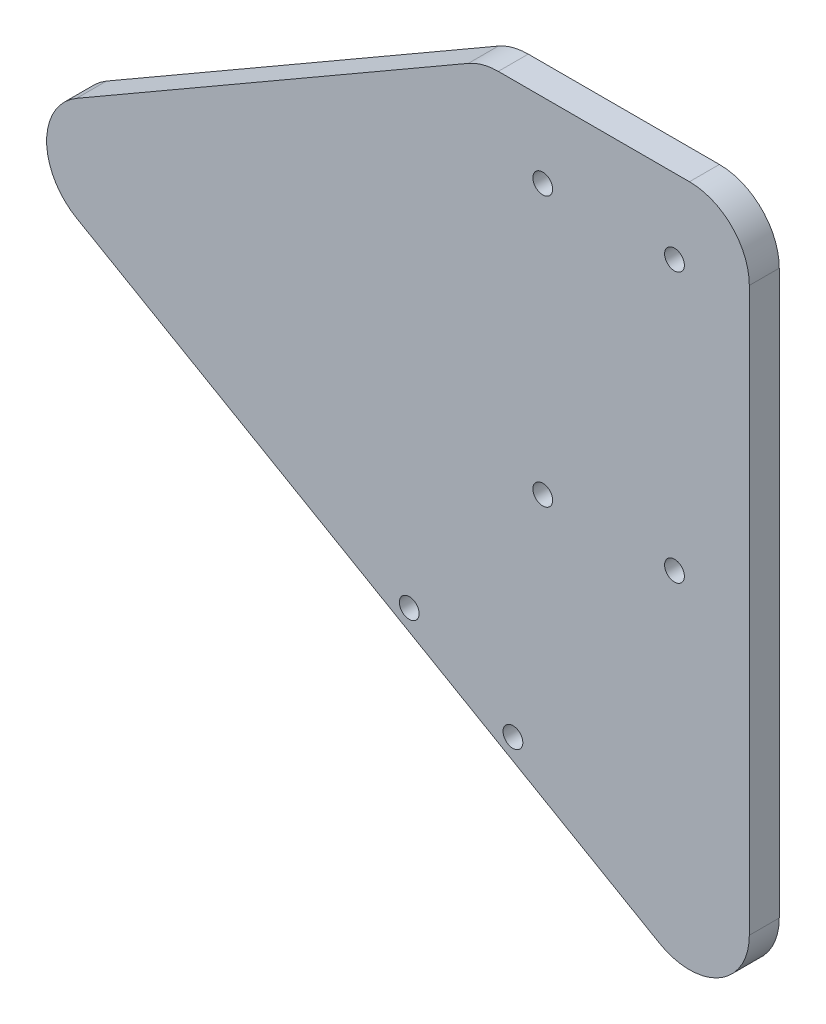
ISO-10303-21;
HEADER;
FILE_DESCRIPTION(('STEP AP214'),'2;1');
FILE_NAME('part.step','',(''),(''),'','','');
FILE_SCHEMA(('AUTOMOTIVE_DESIGN { 1 0 10303 214 1 1 1 1 }'));
ENDSEC;
DATA;
#1=APPLICATION_CONTEXT('core data for automotive mechanical design processes');
#2=APPLICATION_PROTOCOL_DEFINITION('international standard','automotive_design',2000,#1);
#3=PRODUCT_CONTEXT('',#1,'mechanical');
#4=PRODUCT('Part','Part','',(#3));
#5=PRODUCT_RELATED_PRODUCT_CATEGORY('part','',(#4));
#6=PRODUCT_DEFINITION_FORMATION('','',#4);
#7=PRODUCT_DEFINITION_CONTEXT('part definition',#1,'design');
#8=PRODUCT_DEFINITION('design','',#6,#7);
#9=PRODUCT_DEFINITION_SHAPE('','',#8);
#10=(LENGTH_UNIT() NAMED_UNIT(*) SI_UNIT(.MILLI.,.METRE.));
#11=(NAMED_UNIT(*) PLANE_ANGLE_UNIT() SI_UNIT($,.RADIAN.));
#12=(NAMED_UNIT(*) SI_UNIT($,.STERADIAN.) SOLID_ANGLE_UNIT());
#13=UNCERTAINTY_MEASURE_WITH_UNIT(LENGTH_MEASURE(1.E-05),#10,'distance_accuracy_value','');
#14=(GEOMETRIC_REPRESENTATION_CONTEXT(3) GLOBAL_UNCERTAINTY_ASSIGNED_CONTEXT((#13)) GLOBAL_UNIT_ASSIGNED_CONTEXT((#10,
#11,#12)) REPRESENTATION_CONTEXT('',''));
#15=CARTESIAN_POINT('',(0.,0.,0.));
#16=DIRECTION('',(0.,0.,1.));
#17=DIRECTION('',(1.,0.,0.));
#18=AXIS2_PLACEMENT_3D('',#15,#16,#17);
#19=CARTESIAN_POINT('',(13.5,25.,5.));
#20=DIRECTION('',(0.,0.,1.));
#21=DIRECTION('',(1.,0.,0.));
#22=AXIS2_PLACEMENT_3D('',#19,#20,#21);
#23=CYLINDRICAL_SURFACE('',#22,10.);
#24=CARTESIAN_POINT('',(13.5,25.,5.));
#25=DIRECTION('',(0.,0.,1.));
#26=DIRECTION('',(1.,0.,0.));
#27=AXIS2_PLACEMENT_3D('',#24,#25,#26);
#28=CIRCLE('',#27,10.);
#29=CARTESIAN_POINT('',(23.5,25.,5.));
#30=VERTEX_POINT('',#29);
#31=CARTESIAN_POINT('',(13.5,35.,5.));
#32=VERTEX_POINT('',#31);
#33=EDGE_CURVE('E105',#30,#32,#28,.T.);
#34=ORIENTED_EDGE('',*,*,#33,.F.);
#35=DIRECTION('',(0.,0.,1.));
#36=VECTOR('',#35,1.);
#37=CARTESIAN_POINT('',(23.5,25.,5.));
#38=LINE('',#37,#36);
#39=CARTESIAN_POINT('',(23.5,25.,0.));
#40=VERTEX_POINT('',#39);
#41=EDGE_CURVE('E169',#40,#30,#38,.T.);
#42=ORIENTED_EDGE('',*,*,#41,.F.);
#43=CARTESIAN_POINT('',(13.5,25.,0.));
#44=DIRECTION('',(0.,0.,-1.));
#45=DIRECTION('',(1.,0.,0.));
#46=AXIS2_PLACEMENT_3D('',#43,#44,#45);
#47=CIRCLE('',#46,10.);
#48=CARTESIAN_POINT('',(13.5,35.,0.));
#49=VERTEX_POINT('',#48);
#50=EDGE_CURVE('E11',#49,#40,#47,.T.);
#51=ORIENTED_EDGE('',*,*,#50,.F.);
#52=DIRECTION('',(0.,0.,-1.));
#53=VECTOR('',#52,1.);
#54=CARTESIAN_POINT('',(13.5,35.,0.));
#55=LINE('',#54,#53);
#56=EDGE_CURVE('E121',#32,#49,#55,.T.);
#57=ORIENTED_EDGE('',*,*,#56,.F.);
#58=EDGE_LOOP('',(#34,#42,#51,#57));
#59=FACE_BOUND('',#58,.T.);
#60=ADVANCED_FACE('F17',(#59),#23,.T.);
#61=CARTESIAN_POINT('',(-18.4241377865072,25.,5.));
#62=DIRECTION('',(0.,0.,-1.));
#63=DIRECTION('',(-1.,0.,0.));
#64=AXIS2_PLACEMENT_3D('',#61,#62,#63);
#65=CYLINDRICAL_SURFACE('',#64,10.);
#66=CARTESIAN_POINT('',(-18.4241377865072,25.,5.));
#67=DIRECTION('',(0.,0.,1.));
#68=DIRECTION('',(1.,0.,0.));
#69=AXIS2_PLACEMENT_3D('',#66,#67,#68);
#70=CIRCLE('',#69,10.);
#71=CARTESIAN_POINT('',(-18.4241377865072,35.,5.));
#72=VERTEX_POINT('',#71);
#73=CARTESIAN_POINT('',(-23.4241377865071,33.6602540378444,5.));
#74=VERTEX_POINT('',#73);
#75=EDGE_CURVE('E38',#72,#74,#70,.T.);
#76=ORIENTED_EDGE('',*,*,#75,.F.);
#77=DIRECTION('',(0.,0.,1.));
#78=VECTOR('',#77,1.);
#79=CARTESIAN_POINT('',(-18.4241377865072,35.,5.));
#80=LINE('',#79,#78);
#81=CARTESIAN_POINT('',(-18.4241377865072,35.,0.));
#82=VERTEX_POINT('',#81);
#83=EDGE_CURVE('E130',#82,#72,#80,.T.);
#84=ORIENTED_EDGE('',*,*,#83,.F.);
#85=CARTESIAN_POINT('',(-18.4241377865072,25.,0.));
#86=DIRECTION('',(0.,0.,-1.));
#87=DIRECTION('',(1.,0.,0.));
#88=AXIS2_PLACEMENT_3D('',#85,#86,#87);
#89=CIRCLE('',#88,10.);
#90=CARTESIAN_POINT('',(-23.4241377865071,33.6602540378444,0.));
#91=VERTEX_POINT('',#90);
#92=EDGE_CURVE('E25',#91,#82,#89,.T.);
#93=ORIENTED_EDGE('',*,*,#92,.F.);
#94=DIRECTION('',(0.,0.,-1.));
#95=VECTOR('',#94,1.);
#96=CARTESIAN_POINT('',(-23.4241377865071,33.6602540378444,5.));
#97=LINE('',#96,#95);
#98=EDGE_CURVE('E144',#74,#91,#97,.T.);
#99=ORIENTED_EDGE('',*,*,#98,.F.);
#100=EDGE_LOOP('',(#76,#84,#93,#99));
#101=FACE_BOUND('',#100,.T.);
#102=ADVANCED_FACE('F167',(#101),#65,.T.);
#103=CARTESIAN_POINT('',(-83.8621539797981,-12.7806562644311,5.));
#104=DIRECTION('',(0.,0.,1.));
#105=DIRECTION('',(1.,0.,0.));
#106=AXIS2_PLACEMENT_3D('',#103,#104,#105);
#107=CYLINDRICAL_SURFACE('',#106,10.);
#108=CARTESIAN_POINT('',(-83.8621539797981,-12.7806562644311,5.));
#109=DIRECTION('',(0.,0.,1.));
#110=DIRECTION('',(1.,0.,0.));
#111=AXIS2_PLACEMENT_3D('',#108,#109,#110);
#112=CIRCLE('',#111,10.);
#113=CARTESIAN_POINT('',(-88.8621539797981,-4.1204022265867,5.));
#114=VERTEX_POINT('',#113);
#115=CARTESIAN_POINT('',(-88.8621539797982,-21.4409103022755,5.));
#116=VERTEX_POINT('',#115);
#117=EDGE_CURVE('E49',#114,#116,#112,.T.);
#118=ORIENTED_EDGE('',*,*,#117,.F.);
#119=DIRECTION('',(0.,0.,1.));
#120=VECTOR('',#119,1.);
#121=CARTESIAN_POINT('',(-88.8621539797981,-4.12040222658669,5.));
#122=LINE('',#121,#120);
#123=CARTESIAN_POINT('',(-88.8621539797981,-4.1204022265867,0.));
#124=VERTEX_POINT('',#123);
#125=EDGE_CURVE('E145',#124,#114,#122,.T.);
#126=ORIENTED_EDGE('',*,*,#125,.F.);
#127=CARTESIAN_POINT('',(-83.8621539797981,-12.7806562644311,0.));
#128=DIRECTION('',(0.,0.,-1.));
#129=DIRECTION('',(1.,0.,0.));
#130=AXIS2_PLACEMENT_3D('',#127,#128,#129);
#131=CIRCLE('',#130,10.);
#132=CARTESIAN_POINT('',(-88.8621539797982,-21.4409103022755,0.));
#133=VERTEX_POINT('',#132);
#134=EDGE_CURVE('E156',#133,#124,#131,.T.);
#135=ORIENTED_EDGE('',*,*,#134,.F.);
#136=DIRECTION('',(0.,0.,-1.));
#137=VECTOR('',#136,1.);
#138=CARTESIAN_POINT('',(-88.8621539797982,-21.4409103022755,0.));
#139=LINE('',#138,#137);
#140=EDGE_CURVE('E182',#116,#133,#139,.T.);
#141=ORIENTED_EDGE('',*,*,#140,.F.);
#142=EDGE_LOOP('',(#118,#126,#135,#141));
#143=FACE_BOUND('',#142,.T.);
#144=ADVANCED_FACE('F282',(#143),#107,.T.);
#145=CARTESIAN_POINT('',(13.5,-68.9927220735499,5.));
#146=DIRECTION('',(0.,0.,-1.));
#147=DIRECTION('',(-1.,0.,0.));
#148=AXIS2_PLACEMENT_3D('',#145,#146,#147);
#149=CYLINDRICAL_SURFACE('',#148,10.);
#150=CARTESIAN_POINT('',(13.5,-68.9927220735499,5.));
#151=DIRECTION('',(0.,0.,1.));
#152=DIRECTION('',(1.,0.,0.));
#153=AXIS2_PLACEMENT_3D('',#150,#151,#152);
#154=CIRCLE('',#153,10.);
#155=CARTESIAN_POINT('',(8.5,-77.6529761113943,5.));
#156=VERTEX_POINT('',#155);
#157=CARTESIAN_POINT('',(23.5,-68.9927220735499,5.));
#158=VERTEX_POINT('',#157);
#159=EDGE_CURVE('E118',#156,#158,#154,.T.);
#160=ORIENTED_EDGE('',*,*,#159,.F.);
#161=DIRECTION('',(0.,0.,1.));
#162=VECTOR('',#161,1.);
#163=CARTESIAN_POINT('',(8.5,-77.6529761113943,5.));
#164=LINE('',#163,#162);
#165=CARTESIAN_POINT('',(8.5,-77.6529761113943,0.));
#166=VERTEX_POINT('',#165);
#167=EDGE_CURVE('E192',#166,#156,#164,.T.);
#168=ORIENTED_EDGE('',*,*,#167,.F.);
#169=CARTESIAN_POINT('',(13.5,-68.9927220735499,0.));
#170=DIRECTION('',(0.,0.,-1.));
#171=DIRECTION('',(1.,0.,0.));
#172=AXIS2_PLACEMENT_3D('',#169,#170,#171);
#173=CIRCLE('',#172,10.);
#174=CARTESIAN_POINT('',(23.5,-68.9927220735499,0.));
#175=VERTEX_POINT('',#174);
#176=EDGE_CURVE('E155',#175,#166,#173,.T.);
#177=ORIENTED_EDGE('',*,*,#176,.F.);
#178=DIRECTION('',(0.,0.,-1.));
#179=VECTOR('',#178,1.);
#180=CARTESIAN_POINT('',(23.5,-68.9927220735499,5.));
#181=LINE('',#180,#179);
#182=EDGE_CURVE('E176',#158,#175,#181,.T.);
#183=ORIENTED_EDGE('',*,*,#182,.F.);
#184=EDGE_LOOP('',(#160,#168,#177,#183));
#185=FACE_BOUND('',#184,.T.);
#186=ADVANCED_FACE('F272',(#185),#149,.T.);
#187=CARTESIAN_POINT('',(0.,0.,0.));
#188=DIRECTION('',(0.,0.,1.));
#189=DIRECTION('',(1.,0.,0.));
#190=AXIS2_PLACEMENT_3D('',#187,#188,#189);
#191=PLANE('',#190);
#192=CARTESIAN_POINT('',(11.,22.5,0.));
#193=DIRECTION('',(0.,0.,1.));
#194=DIRECTION('',(1.,0.,0.));
#195=AXIS2_PLACEMENT_3D('',#192,#193,#194);
#196=CIRCLE('',#195,1.65);
#197=CARTESIAN_POINT('',(12.65,22.5,0.));
#198=VERTEX_POINT('',#197);
#199=EDGE_CURVE('E226',#198,#198,#196,.T.);
#200=ORIENTED_EDGE('',*,*,#199,.T.);
#201=EDGE_LOOP('',(#200));
#202=FACE_BOUND('',#201,.T.);
#203=CARTESIAN_POINT('',(-11.,22.5,0.));
#204=DIRECTION('',(0.,0.,1.));
#205=DIRECTION('',(1.,0.,0.));
#206=AXIS2_PLACEMENT_3D('',#203,#204,#205);
#207=CIRCLE('',#206,1.65);
#208=CARTESIAN_POINT('',(-9.35,22.5,0.));
#209=VERTEX_POINT('',#208);
#210=EDGE_CURVE('E200',#209,#209,#207,.T.);
#211=ORIENTED_EDGE('',*,*,#210,.T.);
#212=EDGE_LOOP('',(#211));
#213=FACE_BOUND('',#212,.T.);
#214=CARTESIAN_POINT('',(-11.,-22.5,0.));
#215=DIRECTION('',(0.,0.,1.));
#216=DIRECTION('',(1.,0.,0.));
#217=AXIS2_PLACEMENT_3D('',#214,#215,#216);
#218=CIRCLE('',#217,1.65);
#219=CARTESIAN_POINT('',(-9.35,-22.5,0.));
#220=VERTEX_POINT('',#219);
#221=EDGE_CURVE('E208',#220,#220,#218,.T.);
#222=ORIENTED_EDGE('',*,*,#221,.T.);
#223=EDGE_LOOP('',(#222));
#224=FACE_BOUND('',#223,.T.);
#225=CARTESIAN_POINT('',(11.,-22.5,0.));
#226=DIRECTION('',(0.,0.,1.));
#227=DIRECTION('',(1.,0.,0.));
#228=AXIS2_PLACEMENT_3D('',#225,#226,#227);
#229=CIRCLE('',#228,1.65);
#230=CARTESIAN_POINT('',(12.65,-22.5,0.));
#231=VERTEX_POINT('',#230);
#232=EDGE_CURVE('E219',#231,#231,#229,.T.);
#233=ORIENTED_EDGE('',*,*,#232,.T.);
#234=EDGE_LOOP('',(#233));
#235=FACE_BOUND('',#234,.T.);
#236=CARTESIAN_POINT('',(-15.9807621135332,-60.054899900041,0.));
#237=DIRECTION('',(0.,0.,1.));
#238=DIRECTION('',(1.,0.,0.));
#239=AXIS2_PLACEMENT_3D('',#236,#237,#238);
#240=CIRCLE('',#239,1.65);
#241=CARTESIAN_POINT('',(-14.3307621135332,-60.054899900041,0.));
#242=VERTEX_POINT('',#241);
#243=EDGE_CURVE('E243',#242,#242,#240,.T.);
#244=ORIENTED_EDGE('',*,*,#243,.T.);
#245=EDGE_LOOP('',(#244));
#246=FACE_BOUND('',#245,.T.);
#247=CARTESIAN_POINT('',(-33.301270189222,-50.054899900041,0.));
#248=DIRECTION('',(0.,0.,1.));
#249=DIRECTION('',(1.,0.,0.));
#250=AXIS2_PLACEMENT_3D('',#247,#248,#249);
#251=CIRCLE('',#250,1.65);
#252=CARTESIAN_POINT('',(-31.651270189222,-50.054899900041,0.));
#253=VERTEX_POINT('',#252);
#254=EDGE_CURVE('E248',#253,#253,#251,.T.);
#255=ORIENTED_EDGE('',*,*,#254,.T.);
#256=EDGE_LOOP('',(#255));
#257=FACE_BOUND('',#256,.T.);
#258=DIRECTION('',(0.,-1.,0.));
#259=VECTOR('',#258,1.);
#260=CARTESIAN_POINT('',(23.5,0.,0.));
#261=LINE('',#260,#259);
#262=EDGE_CURVE('E173',#40,#175,#261,.T.);
#263=ORIENTED_EDGE('',*,*,#262,.T.);
#264=ORIENTED_EDGE('',*,*,#176,.T.);
#265=DIRECTION('',(-0.866025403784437,0.5,0.));
#266=VECTOR('',#265,1.);
#267=CARTESIAN_POINT('',(-31.4997249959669,-54.5591241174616,0.));
#268=LINE('',#267,#266);
#269=EDGE_CURVE('E196',#166,#133,#268,.T.);
#270=ORIENTED_EDGE('',*,*,#269,.T.);
#271=ORIENTED_EDGE('',*,*,#134,.T.);
#272=DIRECTION('',(-0.866025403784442,-0.5,0.));
#273=VECTOR('',#272,1.);
#274=CARTESIAN_POINT('',(-20.4313519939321,35.3881397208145,0.));
#275=LINE('',#274,#273);
#276=EDGE_CURVE('E126',#91,#124,#275,.T.);
#277=ORIENTED_EDGE('',*,*,#276,.F.);
#278=ORIENTED_EDGE('',*,*,#92,.T.);
#279=DIRECTION('',(-1.,0.,0.));
#280=VECTOR('',#279,1.);
#281=CARTESIAN_POINT('',(0.,35.,0.));
#282=LINE('',#281,#280);
#283=EDGE_CURVE('E137',#49,#82,#282,.T.);
#284=ORIENTED_EDGE('',*,*,#283,.F.);
#285=ORIENTED_EDGE('',*,*,#50,.T.);
#286=EDGE_LOOP('',(#263,#264,#270,#271,#277,#278,#284,#285));
#287=FACE_BOUND('',#286,.T.);
#288=ADVANCED_FACE('F164',(#202,#213,#224,#235,#246,#257,#287),#191,.F.);
#289=CARTESIAN_POINT('',(0.,0.,5.));
#290=DIRECTION('',(0.,0.,1.));
#291=DIRECTION('',(1.,0.,0.));
#292=AXIS2_PLACEMENT_3D('',#289,#290,#291);
#293=PLANE('',#292);
#294=CARTESIAN_POINT('',(11.,22.5,5.));
#295=DIRECTION('',(0.,0.,1.));
#296=DIRECTION('',(1.,0.,0.));
#297=AXIS2_PLACEMENT_3D('',#294,#295,#296);
#298=CIRCLE('',#297,1.65);
#299=CARTESIAN_POINT('',(12.65,22.5,5.));
#300=VERTEX_POINT('',#299);
#301=EDGE_CURVE('E230',#300,#300,#298,.T.);
#302=ORIENTED_EDGE('',*,*,#301,.F.);
#303=EDGE_LOOP('',(#302));
#304=FACE_BOUND('',#303,.T.);
#305=CARTESIAN_POINT('',(-11.,22.5,5.));
#306=DIRECTION('',(0.,0.,1.));
#307=DIRECTION('',(1.,0.,0.));
#308=AXIS2_PLACEMENT_3D('',#305,#306,#307);
#309=CIRCLE('',#308,1.65);
#310=CARTESIAN_POINT('',(-9.35,22.5,5.));
#311=VERTEX_POINT('',#310);
#312=EDGE_CURVE('E204',#311,#311,#309,.T.);
#313=ORIENTED_EDGE('',*,*,#312,.F.);
#314=EDGE_LOOP('',(#313));
#315=FACE_BOUND('',#314,.T.);
#316=CARTESIAN_POINT('',(-11.,-22.5,5.));
#317=DIRECTION('',(0.,0.,1.));
#318=DIRECTION('',(1.,0.,0.));
#319=AXIS2_PLACEMENT_3D('',#316,#317,#318);
#320=CIRCLE('',#319,1.65);
#321=CARTESIAN_POINT('',(-9.35,-22.5,5.));
#322=VERTEX_POINT('',#321);
#323=EDGE_CURVE('E212',#322,#322,#320,.T.);
#324=ORIENTED_EDGE('',*,*,#323,.F.);
#325=EDGE_LOOP('',(#324));
#326=FACE_BOUND('',#325,.T.);
#327=CARTESIAN_POINT('',(11.,-22.5,5.));
#328=DIRECTION('',(0.,0.,1.));
#329=DIRECTION('',(1.,0.,0.));
#330=AXIS2_PLACEMENT_3D('',#327,#328,#329);
#331=CIRCLE('',#330,1.65);
#332=CARTESIAN_POINT('',(12.65,-22.5,5.));
#333=VERTEX_POINT('',#332);
#334=EDGE_CURVE('E223',#333,#333,#331,.T.);
#335=ORIENTED_EDGE('',*,*,#334,.F.);
#336=EDGE_LOOP('',(#335));
#337=FACE_BOUND('',#336,.T.);
#338=CARTESIAN_POINT('',(-15.9807621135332,-60.054899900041,5.));
#339=DIRECTION('',(0.,0.,1.));
#340=DIRECTION('',(1.,0.,0.));
#341=AXIS2_PLACEMENT_3D('',#338,#339,#340);
#342=CIRCLE('',#341,1.65);
#343=CARTESIAN_POINT('',(-14.3307621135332,-60.054899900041,5.));
#344=VERTEX_POINT('',#343);
#345=EDGE_CURVE('E237',#344,#344,#342,.T.);
#346=ORIENTED_EDGE('',*,*,#345,.F.);
#347=EDGE_LOOP('',(#346));
#348=FACE_BOUND('',#347,.T.);
#349=CARTESIAN_POINT('',(-33.301270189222,-50.054899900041,5.));
#350=DIRECTION('',(0.,0.,1.));
#351=DIRECTION('',(1.,0.,0.));
#352=AXIS2_PLACEMENT_3D('',#349,#350,#351);
#353=CIRCLE('',#352,1.65);
#354=CARTESIAN_POINT('',(-31.651270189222,-50.054899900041,5.));
#355=VERTEX_POINT('',#354);
#356=EDGE_CURVE('E246',#355,#355,#353,.T.);
#357=ORIENTED_EDGE('',*,*,#356,.F.);
#358=EDGE_LOOP('',(#357));
#359=FACE_BOUND('',#358,.T.);
#360=DIRECTION('',(-0.866025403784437,0.5,0.));
#361=VECTOR('',#360,1.);
#362=CARTESIAN_POINT('',(-31.4997249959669,-54.5591241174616,5.));
#363=LINE('',#362,#361);
#364=EDGE_CURVE('E188',#156,#116,#363,.T.);
#365=ORIENTED_EDGE('',*,*,#364,.F.);
#366=ORIENTED_EDGE('',*,*,#159,.T.);
#367=DIRECTION('',(0.,-1.,0.));
#368=VECTOR('',#367,1.);
#369=CARTESIAN_POINT('',(23.5,0.,5.));
#370=LINE('',#369,#368);
#371=EDGE_CURVE('E113',#30,#158,#370,.T.);
#372=ORIENTED_EDGE('',*,*,#371,.F.);
#373=ORIENTED_EDGE('',*,*,#33,.T.);
#374=DIRECTION('',(-1.,0.,0.));
#375=VECTOR('',#374,1.);
#376=CARTESIAN_POINT('',(0.,35.,5.));
#377=LINE('',#376,#375);
#378=EDGE_CURVE('E110',#32,#72,#377,.T.);
#379=ORIENTED_EDGE('',*,*,#378,.T.);
#380=ORIENTED_EDGE('',*,*,#75,.T.);
#381=DIRECTION('',(-0.866025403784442,-0.5,0.));
#382=VECTOR('',#381,1.);
#383=CARTESIAN_POINT('',(-20.4313519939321,35.3881397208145,5.));
#384=LINE('',#383,#382);
#385=EDGE_CURVE('E141',#74,#114,#384,.T.);
#386=ORIENTED_EDGE('',*,*,#385,.T.);
#387=ORIENTED_EDGE('',*,*,#117,.T.);
#388=EDGE_LOOP('',(#365,#366,#372,#373,#379,#380,#386,#387));
#389=FACE_BOUND('',#388,.T.);
#390=ADVANCED_FACE('F108',(#304,#315,#326,#337,#348,#359,#389),#293,.T.);
#391=CARTESIAN_POINT('',(-20.4313519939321,35.3881397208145,5.));
#392=DIRECTION('',(0.5,-0.866025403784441,0.));
#393=DIRECTION('',(0.,0.,-1.));
#394=AXIS2_PLACEMENT_3D('',#391,#392,#393);
#395=PLANE('',#394);
#396=ORIENTED_EDGE('',*,*,#276,.T.);
#397=ORIENTED_EDGE('',*,*,#125,.T.);
#398=ORIENTED_EDGE('',*,*,#385,.F.);
#399=ORIENTED_EDGE('',*,*,#98,.T.);
#400=EDGE_LOOP('',(#396,#397,#398,#399));
#401=FACE_BOUND('',#400,.T.);
#402=ADVANCED_FACE('F262',(#401),#395,.F.);
#403=CARTESIAN_POINT('',(0.,35.,5.));
#404=DIRECTION('',(0.,-1.,0.));
#405=DIRECTION('',(0.,0.,-1.));
#406=AXIS2_PLACEMENT_3D('',#403,#404,#405);
#407=PLANE('',#406);
#408=ORIENTED_EDGE('',*,*,#283,.T.);
#409=ORIENTED_EDGE('',*,*,#83,.T.);
#410=ORIENTED_EDGE('',*,*,#378,.F.);
#411=ORIENTED_EDGE('',*,*,#56,.T.);
#412=EDGE_LOOP('',(#408,#409,#410,#411));
#413=FACE_BOUND('',#412,.T.);
#414=ADVANCED_FACE('F128',(#413),#407,.F.);
#415=CARTESIAN_POINT('',(23.5,0.,5.));
#416=DIRECTION('',(1.,0.,0.));
#417=DIRECTION('',(0.,1.,0.));
#418=AXIS2_PLACEMENT_3D('',#415,#416,#417);
#419=PLANE('',#418);
#420=ORIENTED_EDGE('',*,*,#371,.T.);
#421=ORIENTED_EDGE('',*,*,#182,.T.);
#422=ORIENTED_EDGE('',*,*,#262,.F.);
#423=ORIENTED_EDGE('',*,*,#41,.T.);
#424=EDGE_LOOP('',(#420,#421,#422,#423));
#425=FACE_BOUND('',#424,.T.);
#426=ADVANCED_FACE('F298',(#425),#419,.T.);
#427=CARTESIAN_POINT('',(-31.4997249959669,-54.5591241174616,5.));
#428=DIRECTION('',(-0.5,-0.866025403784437,0.));
#429=DIRECTION('',(-0.866025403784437,0.5,0.));
#430=AXIS2_PLACEMENT_3D('',#427,#428,#429);
#431=PLANE('',#430);
#432=ORIENTED_EDGE('',*,*,#269,.F.);
#433=ORIENTED_EDGE('',*,*,#167,.T.);
#434=ORIENTED_EDGE('',*,*,#364,.T.);
#435=ORIENTED_EDGE('',*,*,#140,.T.);
#436=EDGE_LOOP('',(#432,#433,#434,#435));
#437=FACE_BOUND('',#436,.T.);
#438=ADVANCED_FACE('F295',(#437),#431,.T.);
#439=CARTESIAN_POINT('',(-11.,22.5,5.));
#440=DIRECTION('',(0.,0.,-1.));
#441=DIRECTION('',(-1.,0.,0.));
#442=AXIS2_PLACEMENT_3D('',#439,#440,#441);
#443=CYLINDRICAL_SURFACE('',#442,1.65);
#444=ORIENTED_EDGE('',*,*,#210,.F.);
#445=EDGE_LOOP('',(#444));
#446=FACE_BOUND('',#445,.T.);
#447=ORIENTED_EDGE('',*,*,#312,.T.);
#448=EDGE_LOOP('',(#447));
#449=FACE_BOUND('',#448,.T.);
#450=ADVANCED_FACE('F305',(#446,#449),#443,.F.);
#451=CARTESIAN_POINT('',(-11.,-22.5,5.));
#452=DIRECTION('',(0.,0.,-1.));
#453=DIRECTION('',(-1.,0.,0.));
#454=AXIS2_PLACEMENT_3D('',#451,#452,#453);
#455=CYLINDRICAL_SURFACE('',#454,1.65);
#456=ORIENTED_EDGE('',*,*,#221,.F.);
#457=EDGE_LOOP('',(#456));
#458=FACE_BOUND('',#457,.T.);
#459=ORIENTED_EDGE('',*,*,#323,.T.);
#460=EDGE_LOOP('',(#459));
#461=FACE_BOUND('',#460,.T.);
#462=ADVANCED_FACE('F317',(#458,#461),#455,.F.);
#463=CARTESIAN_POINT('',(11.,-22.5,5.));
#464=DIRECTION('',(0.,0.,-1.));
#465=DIRECTION('',(-1.,0.,0.));
#466=AXIS2_PLACEMENT_3D('',#463,#464,#465);
#467=CYLINDRICAL_SURFACE('',#466,1.65);
#468=ORIENTED_EDGE('',*,*,#232,.F.);
#469=EDGE_LOOP('',(#468));
#470=FACE_BOUND('',#469,.T.);
#471=ORIENTED_EDGE('',*,*,#334,.T.);
#472=EDGE_LOOP('',(#471));
#473=FACE_BOUND('',#472,.T.);
#474=ADVANCED_FACE('F313',(#470,#473),#467,.F.);
#475=CARTESIAN_POINT('',(11.,22.5,5.));
#476=DIRECTION('',(0.,0.,-1.));
#477=DIRECTION('',(-1.,0.,0.));
#478=AXIS2_PLACEMENT_3D('',#475,#476,#477);
#479=CYLINDRICAL_SURFACE('',#478,1.65);
#480=ORIENTED_EDGE('',*,*,#199,.F.);
#481=EDGE_LOOP('',(#480));
#482=FACE_BOUND('',#481,.T.);
#483=ORIENTED_EDGE('',*,*,#301,.T.);
#484=EDGE_LOOP('',(#483));
#485=FACE_BOUND('',#484,.T.);
#486=ADVANCED_FACE('F309',(#482,#485),#479,.F.);
#487=CARTESIAN_POINT('',(-15.9807621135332,-60.054899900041,0.));
#488=DIRECTION('',(0.,0.,1.));
#489=DIRECTION('',(1.,0.,0.));
#490=AXIS2_PLACEMENT_3D('',#487,#488,#489);
#491=CYLINDRICAL_SURFACE('',#490,1.65);
#492=ORIENTED_EDGE('',*,*,#345,.T.);
#493=EDGE_LOOP('',(#492));
#494=FACE_BOUND('',#493,.T.);
#495=ORIENTED_EDGE('',*,*,#243,.F.);
#496=EDGE_LOOP('',(#495));
#497=FACE_BOUND('',#496,.T.);
#498=ADVANCED_FACE('F312',(#494,#497),#491,.F.);
#499=CARTESIAN_POINT('',(-33.301270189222,-50.054899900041,0.));
#500=DIRECTION('',(0.,0.,1.));
#501=DIRECTION('',(1.,0.,0.));
#502=AXIS2_PLACEMENT_3D('',#499,#500,#501);
#503=CYLINDRICAL_SURFACE('',#502,1.65);
#504=ORIENTED_EDGE('',*,*,#356,.T.);
#505=EDGE_LOOP('',(#504));
#506=FACE_BOUND('',#505,.T.);
#507=ORIENTED_EDGE('',*,*,#254,.F.);
#508=EDGE_LOOP('',(#507));
#509=FACE_BOUND('',#508,.T.);
#510=ADVANCED_FACE('F258',(#506,#509),#503,.F.);
#511=CLOSED_SHELL('',(#60,#102,#144,#186,#288,#390,#402,#414,#426,#438,#450,#462,#474,#486,#498,#510));
#512=MANIFOLD_SOLID_BREP('B1',#511);
#513=ADVANCED_BREP_SHAPE_REPRESENTATION('',(#18,#512),#14);
#514=SHAPE_DEFINITION_REPRESENTATION(#9,#513);
ENDSEC;
END-ISO-10303-21;
